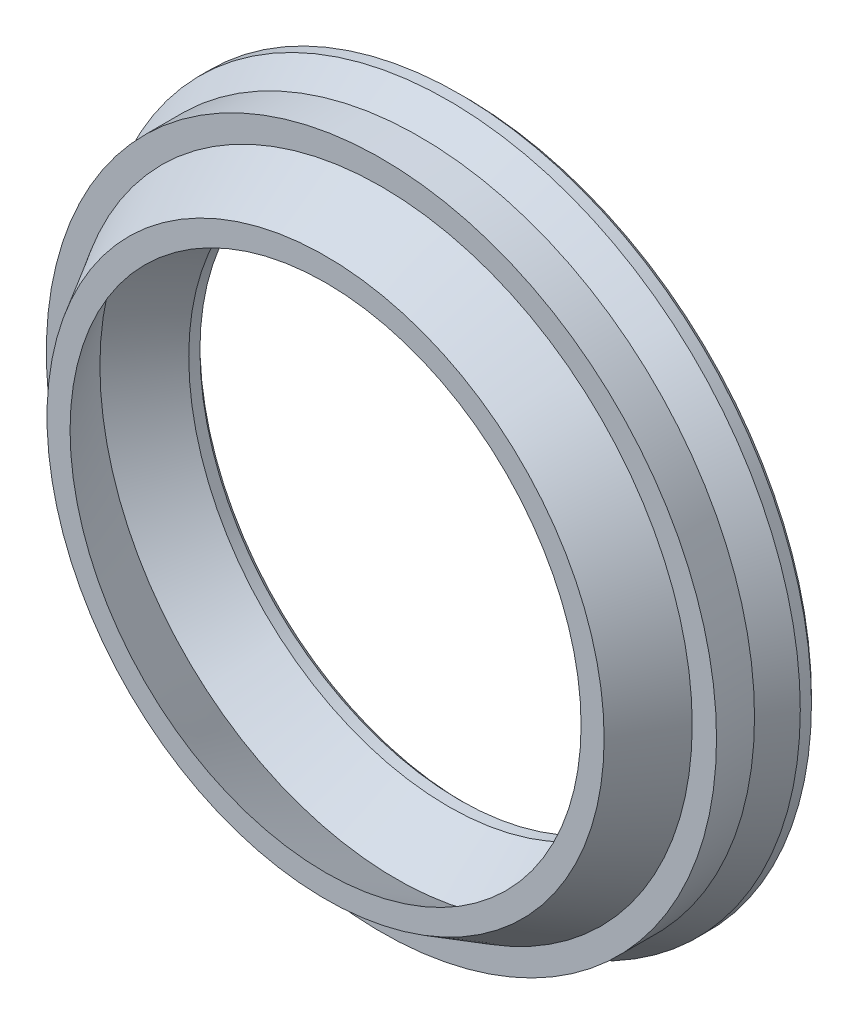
ISO-10303-21;
HEADER;
FILE_DESCRIPTION(('STEP AP214'),'2;1');
FILE_NAME('part.step','',(''),(''),'','','');
FILE_SCHEMA(('AUTOMOTIVE_DESIGN { 1 0 10303 214 1 1 1 1 }'));
ENDSEC;
DATA;
#1=APPLICATION_CONTEXT('core data for automotive mechanical design processes');
#2=APPLICATION_PROTOCOL_DEFINITION('international standard','automotive_design',2000,#1);
#3=PRODUCT_CONTEXT('',#1,'mechanical');
#4=PRODUCT('Part','Part','',(#3));
#5=PRODUCT_RELATED_PRODUCT_CATEGORY('part','',(#4));
#6=PRODUCT_DEFINITION_FORMATION('','',#4);
#7=PRODUCT_DEFINITION_CONTEXT('part definition',#1,'design');
#8=PRODUCT_DEFINITION('design','',#6,#7);
#9=PRODUCT_DEFINITION_SHAPE('','',#8);
#10=(LENGTH_UNIT() NAMED_UNIT(*) SI_UNIT(.MILLI.,.METRE.));
#11=(NAMED_UNIT(*) PLANE_ANGLE_UNIT() SI_UNIT($,.RADIAN.));
#12=(NAMED_UNIT(*) SI_UNIT($,.STERADIAN.) SOLID_ANGLE_UNIT());
#13=UNCERTAINTY_MEASURE_WITH_UNIT(LENGTH_MEASURE(1.E-05),#10,'distance_accuracy_value','');
#14=(GEOMETRIC_REPRESENTATION_CONTEXT(3) GLOBAL_UNCERTAINTY_ASSIGNED_CONTEXT((#13)) GLOBAL_UNIT_ASSIGNED_CONTEXT((#10,
#11,#12)) REPRESENTATION_CONTEXT('',''));
#15=CARTESIAN_POINT('',(0.,0.,0.));
#16=DIRECTION('',(0.,0.,1.));
#17=DIRECTION('',(1.,0.,0.));
#18=AXIS2_PLACEMENT_3D('',#15,#16,#17);
#19=CARTESIAN_POINT('',(-21.,0.,-8.33333333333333));
#20=DIRECTION('',(0.,0.,1.));
#21=DIRECTION('',(1.,0.,0.));
#22=AXIS2_PLACEMENT_3D('',#19,#20,#21);
#23=PLANE('',#22);
#24=CARTESIAN_POINT('',(0.,0.,-8.33333333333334));
#25=DIRECTION('',(0.,0.,1.));
#26=DIRECTION('',(1.,0.,0.));
#27=AXIS2_PLACEMENT_3D('',#24,#25,#26);
#28=CIRCLE('',#27,15.8333333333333);
#29=CARTESIAN_POINT('',(15.8333333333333,0.,-8.33333333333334));
#30=VERTEX_POINT('',#29);
#31=EDGE_CURVE('E46',#30,#30,#28,.T.);
#32=ORIENTED_EDGE('',*,*,#31,.T.);
#33=EDGE_LOOP('',(#32));
#34=FACE_BOUND('',#33,.T.);
#35=CARTESIAN_POINT('',(0.,0.,-8.33333333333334));
#36=DIRECTION('',(0.,0.,1.));
#37=DIRECTION('',(1.,0.,0.));
#38=AXIS2_PLACEMENT_3D('',#35,#36,#37);
#39=CIRCLE('',#38,17.25);
#40=CARTESIAN_POINT('',(17.25,0.,-8.33333333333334));
#41=VERTEX_POINT('',#40);
#42=EDGE_CURVE('E84',#41,#41,#39,.T.);
#43=ORIENTED_EDGE('',*,*,#42,.F.);
#44=EDGE_LOOP('',(#43));
#45=FACE_BOUND('',#44,.T.);
#46=ADVANCED_FACE('F31',(#34,#45),#23,.F.);
#47=CARTESIAN_POINT('',(0.,0.,-7.33333333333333));
#48=DIRECTION('',(0.,0.,-1.));
#49=DIRECTION('',(-1.,0.,0.));
#50=AXIS2_PLACEMENT_3D('',#47,#48,#49);
#51=CONICAL_SURFACE('',#50,21.,0.523598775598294);
#52=CARTESIAN_POINT('',(0.,0.,-5.60128252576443));
#53=DIRECTION('',(0.,0.,1.));
#54=DIRECTION('',(1.,0.,0.));
#55=AXIS2_PLACEMENT_3D('',#52,#53,#54);
#56=CIRCLE('',#55,20.);
#57=CARTESIAN_POINT('',(20.,0.,-5.60128252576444));
#58=VERTEX_POINT('',#57);
#59=EDGE_CURVE('E51',#58,#58,#56,.T.);
#60=ORIENTED_EDGE('',*,*,#59,.F.);
#61=EDGE_LOOP('',(#60));
#62=FACE_BOUND('',#61,.T.);
#63=CARTESIAN_POINT('',(0.,0.,-7.33333333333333));
#64=DIRECTION('',(0.,0.,1.));
#65=DIRECTION('',(1.,0.,0.));
#66=AXIS2_PLACEMENT_3D('',#63,#64,#65);
#67=CIRCLE('',#66,21.);
#68=CARTESIAN_POINT('',(21.,0.,-7.33333333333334));
#69=VERTEX_POINT('',#68);
#70=EDGE_CURVE('E72',#69,#69,#67,.T.);
#71=ORIENTED_EDGE('',*,*,#70,.T.);
#72=EDGE_LOOP('',(#71));
#73=FACE_BOUND('',#72,.T.);
#74=ADVANCED_FACE('F91',(#62,#73),#51,.T.);
#75=CARTESIAN_POINT('',(0.,0.,7.49536847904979));
#76=DIRECTION('',(0.,0.,1.));
#77=DIRECTION('',(1.,0.,0.));
#78=AXIS2_PLACEMENT_3D('',#75,#76,#77);
#79=CYLINDRICAL_SURFACE('',#78,20.);
#80=CARTESIAN_POINT('',(0.,0.,-3.33333333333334));
#81=DIRECTION('',(0.,0.,1.));
#82=DIRECTION('',(1.,0.,0.));
#83=AXIS2_PLACEMENT_3D('',#80,#81,#82);
#84=CIRCLE('',#83,20.);
#85=CARTESIAN_POINT('',(20.,0.,-3.33333333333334));
#86=VERTEX_POINT('',#85);
#87=EDGE_CURVE('E54',#86,#86,#84,.T.);
#88=ORIENTED_EDGE('',*,*,#87,.F.);
#89=EDGE_LOOP('',(#88));
#90=FACE_BOUND('',#89,.T.);
#91=ORIENTED_EDGE('',*,*,#59,.T.);
#92=EDGE_LOOP('',(#91));
#93=FACE_BOUND('',#92,.T.);
#94=ADVANCED_FACE('F98',(#90,#93),#79,.T.);
#95=CARTESIAN_POINT('',(-20.,0.,-3.33333333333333));
#96=DIRECTION('',(0.,0.,-1.));
#97=DIRECTION('',(-1.,0.,0.));
#98=AXIS2_PLACEMENT_3D('',#95,#96,#97);
#99=PLANE('',#98);
#100=CARTESIAN_POINT('',(0.,0.,-3.33333333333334));
#101=DIRECTION('',(0.,0.,1.));
#102=DIRECTION('',(1.,0.,0.));
#103=AXIS2_PLACEMENT_3D('',#100,#101,#102);
#104=CIRCLE('',#103,18.5495008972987);
#105=CARTESIAN_POINT('',(18.5495008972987,0.,-3.33333333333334));
#106=VERTEX_POINT('',#105);
#107=EDGE_CURVE('E57',#106,#106,#104,.T.);
#108=ORIENTED_EDGE('',*,*,#107,.F.);
#109=EDGE_LOOP('',(#108));
#110=FACE_BOUND('',#109,.T.);
#111=ORIENTED_EDGE('',*,*,#87,.T.);
#112=EDGE_LOOP('',(#111));
#113=FACE_BOUND('',#112,.T.);
#114=ADVANCED_FACE('F216',(#110,#113),#99,.F.);
#115=CARTESIAN_POINT('',(0.,0.,-3.33333333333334));
#116=DIRECTION('',(0.,0.,-1.));
#117=DIRECTION('',(-1.,0.,0.));
#118=AXIS2_PLACEMENT_3D('',#115,#116,#117);
#119=CONICAL_SURFACE('',#118,18.5495008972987,0.523598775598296);
#120=CARTESIAN_POINT('',(0.,0.,0.));
#121=DIRECTION('',(0.,0.,1.));
#122=DIRECTION('',(1.,0.,0.));
#123=AXIS2_PLACEMENT_3D('',#120,#121,#122);
#124=CIRCLE('',#123,16.625);
#125=CARTESIAN_POINT('',(16.625,0.,0.));
#126=VERTEX_POINT('',#125);
#127=EDGE_CURVE('E60',#126,#126,#124,.T.);
#128=ORIENTED_EDGE('',*,*,#127,.F.);
#129=EDGE_LOOP('',(#128));
#130=FACE_BOUND('',#129,.T.);
#131=ORIENTED_EDGE('',*,*,#107,.T.);
#132=EDGE_LOOP('',(#131));
#133=FACE_BOUND('',#132,.T.);
#134=ADVANCED_FACE('F207',(#130,#133),#119,.T.);
#135=CARTESIAN_POINT('',(-16.625,0.,0.));
#136=DIRECTION('',(0.,0.,-1.));
#137=DIRECTION('',(-1.,0.,0.));
#138=AXIS2_PLACEMENT_3D('',#135,#136,#137);
#139=PLANE('',#138);
#140=CARTESIAN_POINT('',(0.,0.,0.));
#141=DIRECTION('',(0.,0.,1.));
#142=DIRECTION('',(1.,0.,0.));
#143=AXIS2_PLACEMENT_3D('',#140,#141,#142);
#144=CIRCLE('',#143,15.25);
#145=CARTESIAN_POINT('',(15.25,0.,0.));
#146=VERTEX_POINT('',#145);
#147=EDGE_CURVE('E63',#146,#146,#144,.T.);
#148=ORIENTED_EDGE('',*,*,#147,.F.);
#149=EDGE_LOOP('',(#148));
#150=FACE_BOUND('',#149,.T.);
#151=ORIENTED_EDGE('',*,*,#127,.T.);
#152=EDGE_LOOP('',(#151));
#153=FACE_BOUND('',#152,.T.);
#154=ADVANCED_FACE('F198',(#150,#153),#139,.F.);
#155=CARTESIAN_POINT('',(0.,0.,0.));
#156=DIRECTION('',(0.,0.,-1.));
#157=DIRECTION('',(-1.,0.,0.));
#158=AXIS2_PLACEMENT_3D('',#155,#156,#157);
#159=CONICAL_SURFACE('',#158,15.25,0.523598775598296);
#160=CARTESIAN_POINT('',(0.,0.,-4.2149601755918));
#161=DIRECTION('',(0.,0.,1.));
#162=DIRECTION('',(1.,0.,0.));
#163=AXIS2_PLACEMENT_3D('',#160,#161,#162);
#164=CIRCLE('',#163,17.6835083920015);
#165=CARTESIAN_POINT('',(17.6835083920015,0.,-4.2149601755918));
#166=VERTEX_POINT('',#165);
#167=EDGE_CURVE('E66',#166,#166,#164,.T.);
#168=ORIENTED_EDGE('',*,*,#167,.F.);
#169=EDGE_LOOP('',(#168));
#170=FACE_BOUND('',#169,.T.);
#171=ORIENTED_EDGE('',*,*,#147,.T.);
#172=EDGE_LOOP('',(#171));
#173=FACE_BOUND('',#172,.T.);
#174=ADVANCED_FACE('F189',(#170,#173),#159,.F.);
#175=CARTESIAN_POINT('',(0.,0.,-4.2149601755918));
#176=DIRECTION('',(0.,0.,1.));
#177=DIRECTION('',(1.,0.,0.));
#178=AXIS2_PLACEMENT_3D('',#175,#176,#177);
#179=CONICAL_SURFACE('',#178,17.6835083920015,0.61086523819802);
#180=CARTESIAN_POINT('',(0.,0.,-7.33333333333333));
#181=DIRECTION('',(0.,0.,1.));
#182=DIRECTION('',(1.,0.,0.));
#183=AXIS2_PLACEMENT_3D('',#180,#181,#182);
#184=CIRCLE('',#183,15.5);
#185=CARTESIAN_POINT('',(15.5,0.,-7.33333333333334));
#186=VERTEX_POINT('',#185);
#187=EDGE_CURVE('E69',#186,#186,#184,.T.);
#188=ORIENTED_EDGE('',*,*,#187,.F.);
#189=EDGE_LOOP('',(#188));
#190=FACE_BOUND('',#189,.T.);
#191=ORIENTED_EDGE('',*,*,#167,.T.);
#192=EDGE_LOOP('',(#191));
#193=FACE_BOUND('',#192,.T.);
#194=ADVANCED_FACE('F110',(#190,#193),#179,.F.);
#195=CARTESIAN_POINT('',(0.,0.,7.49536847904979));
#196=DIRECTION('',(0.,0.,1.));
#197=DIRECTION('',(1.,0.,0.));
#198=AXIS2_PLACEMENT_3D('',#195,#196,#197);
#199=CYLINDRICAL_SURFACE('',#198,15.5);
#200=CARTESIAN_POINT('',(0.,0.,-8.));
#201=DIRECTION('',(0.,0.,1.));
#202=DIRECTION('',(1.,0.,0.));
#203=AXIS2_PLACEMENT_3D('',#200,#201,#202);
#204=CIRCLE('',#203,15.5);
#205=CARTESIAN_POINT('',(15.5,0.,-8.));
#206=VERTEX_POINT('',#205);
#207=EDGE_CURVE('E42',#206,#206,#204,.F.);
#208=ORIENTED_EDGE('',*,*,#207,.T.);
#209=EDGE_LOOP('',(#208));
#210=FACE_BOUND('',#209,.T.);
#211=ORIENTED_EDGE('',*,*,#187,.T.);
#212=EDGE_LOOP('',(#211));
#213=FACE_BOUND('',#212,.T.);
#214=ADVANCED_FACE('F105',(#210,#213),#199,.F.);
#215=CARTESIAN_POINT('',(0.,0.,-8.33333333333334));
#216=DIRECTION('',(0.,0.,1.));
#217=DIRECTION('',(1.,0.,0.));
#218=AXIS2_PLACEMENT_3D('',#215,#216,#217);
#219=CIRCLE('',#218,20.6666666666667);
#220=CARTESIAN_POINT('',(20.6666666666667,0.,-8.33333333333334));
#221=VERTEX_POINT('',#220);
#222=EDGE_CURVE('E10',#221,#221,#219,.F.);
#223=ORIENTED_EDGE('',*,*,#222,.T.);
#224=EDGE_LOOP('',(#223));
#225=FACE_BOUND('',#224,.T.);
#226=CARTESIAN_POINT('',(0.,0.,-8.33333333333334));
#227=DIRECTION('',(0.,0.,1.));
#228=DIRECTION('',(1.,0.,0.));
#229=AXIS2_PLACEMENT_3D('',#226,#227,#228);
#230=CIRCLE('',#229,19.25);
#231=CARTESIAN_POINT('',(19.25,0.,-8.33333333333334));
#232=VERTEX_POINT('',#231);
#233=EDGE_CURVE('E81',#232,#232,#230,.T.);
#234=ORIENTED_EDGE('',*,*,#233,.T.);
#235=EDGE_LOOP('',(#234));
#236=FACE_BOUND('',#235,.T.);
#237=ADVANCED_FACE('F94',(#225,#236),#23,.F.);
#238=CARTESIAN_POINT('',(0.,0.,7.49536847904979));
#239=DIRECTION('',(0.,0.,1.));
#240=DIRECTION('',(1.,0.,0.));
#241=AXIS2_PLACEMENT_3D('',#238,#239,#240);
#242=CYLINDRICAL_SURFACE('',#241,21.);
#243=CARTESIAN_POINT('',(0.,0.,-8.));
#244=DIRECTION('',(0.,0.,1.));
#245=DIRECTION('',(1.,0.,0.));
#246=AXIS2_PLACEMENT_3D('',#243,#244,#245);
#247=CIRCLE('',#246,21.);
#248=CARTESIAN_POINT('',(21.,0.,-8.));
#249=VERTEX_POINT('',#248);
#250=EDGE_CURVE('E38',#249,#249,#247,.T.);
#251=ORIENTED_EDGE('',*,*,#250,.T.);
#252=EDGE_LOOP('',(#251));
#253=FACE_BOUND('',#252,.T.);
#254=ORIENTED_EDGE('',*,*,#70,.F.);
#255=EDGE_LOOP('',(#254));
#256=FACE_BOUND('',#255,.T.);
#257=ADVANCED_FACE('F104',(#253,#256),#242,.T.);
#258=CARTESIAN_POINT('',(0.,0.,-8.33333333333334));
#259=DIRECTION('',(0.,0.,1.));
#260=DIRECTION('',(1.,0.,0.));
#261=AXIS2_PLACEMENT_3D('',#258,#259,#260);
#262=CONICAL_SURFACE('',#261,17.25,0.523598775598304);
#263=CARTESIAN_POINT('',(0.,0.,-7.53333333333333));
#264=DIRECTION('',(0.,0.,1.));
#265=DIRECTION('',(1.,0.,0.));
#266=AXIS2_PLACEMENT_3D('',#263,#264,#265);
#267=CIRCLE('',#266,17.7118802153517);
#268=CARTESIAN_POINT('',(17.7118802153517,0.,-7.53333333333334));
#269=VERTEX_POINT('',#268);
#270=EDGE_CURVE('E75',#269,#269,#267,.T.);
#271=ORIENTED_EDGE('',*,*,#270,.F.);
#272=EDGE_LOOP('',(#271));
#273=FACE_BOUND('',#272,.T.);
#274=ORIENTED_EDGE('',*,*,#42,.T.);
#275=EDGE_LOOP('',(#274));
#276=FACE_BOUND('',#275,.T.);
#277=ADVANCED_FACE('F88',(#273,#276),#262,.T.);
#278=CARTESIAN_POINT('',(18.7881197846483,0.,-7.53333333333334));
#279=DIRECTION('',(0.,0.,1.));
#280=DIRECTION('',(1.,0.,0.));
#281=AXIS2_PLACEMENT_3D('',#278,#279,#280);
#282=PLANE('',#281);
#283=CARTESIAN_POINT('',(0.,0.,-7.53333333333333));
#284=DIRECTION('',(0.,0.,1.));
#285=DIRECTION('',(1.,0.,0.));
#286=AXIS2_PLACEMENT_3D('',#283,#284,#285);
#287=CIRCLE('',#286,18.7881197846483);
#288=CARTESIAN_POINT('',(18.7881197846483,0.,-7.53333333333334));
#289=VERTEX_POINT('',#288);
#290=EDGE_CURVE('E78',#289,#289,#287,.T.);
#291=ORIENTED_EDGE('',*,*,#290,.F.);
#292=EDGE_LOOP('',(#291));
#293=FACE_BOUND('',#292,.T.);
#294=ORIENTED_EDGE('',*,*,#270,.T.);
#295=EDGE_LOOP('',(#294));
#296=FACE_BOUND('',#295,.T.);
#297=ADVANCED_FACE('F119',(#293,#296),#282,.F.);
#298=CARTESIAN_POINT('',(0.,0.,-7.53333333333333));
#299=DIRECTION('',(0.,0.,-1.));
#300=DIRECTION('',(-1.,0.,0.));
#301=AXIS2_PLACEMENT_3D('',#298,#299,#300);
#302=CONICAL_SURFACE('',#301,18.7881197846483,0.523598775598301);
#303=ORIENTED_EDGE('',*,*,#233,.F.);
#304=EDGE_LOOP('',(#303));
#305=FACE_BOUND('',#304,.T.);
#306=ORIENTED_EDGE('',*,*,#290,.T.);
#307=EDGE_LOOP('',(#306));
#308=FACE_BOUND('',#307,.T.);
#309=ADVANCED_FACE('F115',(#305,#308),#302,.F.);
#310=CARTESIAN_POINT('',(0.,0.,-8.33333333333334));
#311=DIRECTION('',(0.,0.,-1.));
#312=DIRECTION('',(-1.,0.,0.));
#313=AXIS2_PLACEMENT_3D('',#310,#311,#312);
#314=CONICAL_SURFACE('',#313,15.8333333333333,0.785398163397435);
#315=ORIENTED_EDGE('',*,*,#207,.F.);
#316=EDGE_LOOP('',(#315));
#317=FACE_BOUND('',#316,.T.);
#318=ORIENTED_EDGE('',*,*,#31,.F.);
#319=EDGE_LOOP('',(#318));
#320=FACE_BOUND('',#319,.T.);
#321=ADVANCED_FACE('F118',(#317,#320),#314,.F.);
#322=CARTESIAN_POINT('',(0.,0.,-8.));
#323=DIRECTION('',(0.,0.,1.));
#324=DIRECTION('',(1.,0.,0.));
#325=AXIS2_PLACEMENT_3D('',#322,#323,#324);
#326=CONICAL_SURFACE('',#325,21.,0.785398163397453);
#327=ORIENTED_EDGE('',*,*,#222,.F.);
#328=EDGE_LOOP('',(#327));
#329=FACE_BOUND('',#328,.T.);
#330=ORIENTED_EDGE('',*,*,#250,.F.);
#331=EDGE_LOOP('',(#330));
#332=FACE_BOUND('',#331,.T.);
#333=ADVANCED_FACE('F33',(#329,#332),#326,.T.);
#334=CLOSED_SHELL('',(#46,#74,#94,#114,#134,#154,#174,#194,#214,#237,#257,#277,#297,#309,#321,#333));
#335=MANIFOLD_SOLID_BREP('B2',#334);
#336=ADVANCED_BREP_SHAPE_REPRESENTATION('',(#18,#335),#14);
#337=SHAPE_DEFINITION_REPRESENTATION(#9,#336);
ENDSEC;
END-ISO-10303-21;
